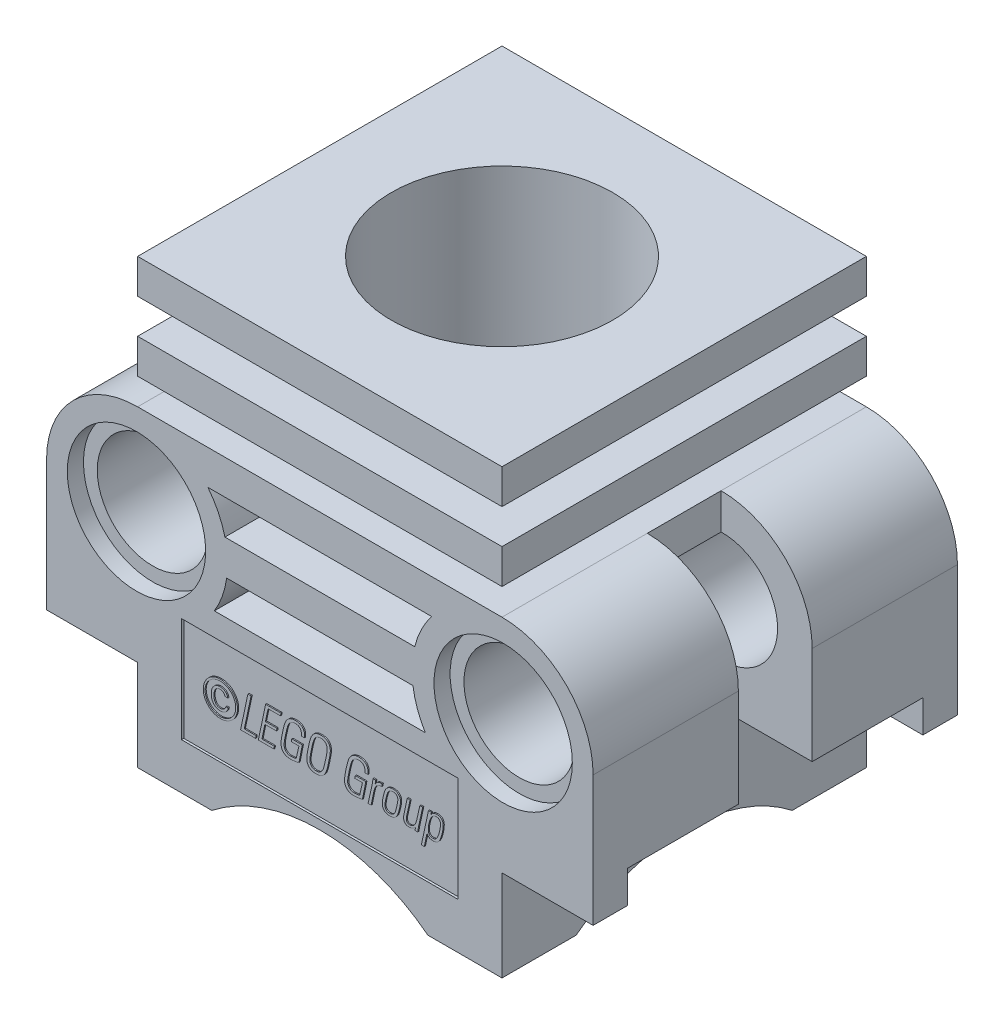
from build123d import *

# Parameters (mm, degrees)
BASE_EXTRUDE_DEPTH  = 7.9
SKETCH2_W           = 12.8
SKETCH2_H           = 12.8
SKETCH2_W_2         = 6.477428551
CUT_EXTRUDE1_DEPTH  = 5.35
SKETCH3_W           = 5.042240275
SKETCH3_H           = 3.2
CUT_EXTRUDE2_DEPTH  = 17.433882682
CUT_EXTRUDE3_DEPTH  = 24.951304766
SKETCH5_R           = 6.3
BOSS_EXTRUDE1_DEPTH = 19.2
SKETCH6_W           = 15.8
SKETCH6_H           = 15.8
BOSS_EXTRUDE2_DEPTH = 1.5
LPATTERN2_COUNT     = 2
LPATTERN2_PITCH     = 3
SKETCH8_R           = 4.8
CUT_EXTRUDE4_DEPTH  = 24.905491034
SKETCH9_R           = 3
CUT_EXTRUDE5_DEPTH  = 0.7
SKETCH10_R          = 2.4
CUT_EXTRUDE6_DEPTH  = 28.14907923
SKETCH12_R          = 7.62
CUT_EXTRUDE8_DEPTH  = 24.905491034
CIRPATTERN1_COUNT   = 2
CIRPATTERN1_ANGLE   = 90
CUT_EXTRUDE9_DEPTH  = 2.5
SKETCH14_W          = 12
SKETCH14_H          = 4.55
CUT_EXTRUDE10_DEPTH = 0.1
BOSS_EXTRUDE4_DEPTH = 0.05
CIRPATTERN2_COUNT   = 2
BOSS_EXTRUDE5_START = -2.85
BOSS_EXTRUDE5_DEPTH = 2.85


with BuildPart() as part:
    # Sketch1 → Base-Extrude (new, symmetric)
    with BuildSketch(Plane.XY):
        with BuildLine():
            Line((-7.9, 0), (7.9, 0))
            Line((7.9, 0), (7.9, 3.95))
            Line((7.9, 3.95), (11.85, 3.95))
            Line((11.85, 3.95), (11.85, 9.6))
            ThreePointArc((11.85, 9.6), (10.693071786, 12.393071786), (7.9, 13.55))
            Line((7.9, 13.55), (-7.9, 13.55))
            ThreePointArc((-7.9, 13.55), (-10.693071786, 12.393071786), (-11.85, 9.6))
            Line((-11.85, 9.6), (-11.85, 3.95))
            Line((-11.85, 3.95), (-7.9, 3.95))
            Line((-7.9, 3.95), (-7.9, 0))
        make_face()
    extrude(amount=BASE_EXTRUDE_DEPTH, both=True)

    # Sketch2 → Cut-Extrude1 (cut)
    with BuildSketch(Plane.XZ):
        Rectangle(SKETCH2_W, SKETCH2_H)
        with Locations((11.138714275, 0)):
            Rectangle(SKETCH2_W_2, SKETCH2_H)
    cut_extrude1 = extrude(amount=-CUT_EXTRUDE1_DEPTH, mode=Mode.SUBTRACT)

    # Sketch3 → Cut-Extrude2 (cut, through all)
    with BuildSketch(Plane.XZ.offset(-5.35)):
        with Locations((10.421120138, 0)):
            Rectangle(SKETCH3_W, SKETCH3_H)
    cut_extrude2 = extrude(amount=-CUT_EXTRUDE2_DEPTH, mode=Mode.SUBTRACT)

    # Mirror1: Cut-Extrude1, Cut-Extrude2 across plane
    add(cut_extrude1.mirror(Plane(origin=(0, 0, 0), x_dir=(0, 0, 1), z_dir=(1, 0, 0))), mode=Mode.SUBTRACT)
    add(cut_extrude2.mirror(Plane(origin=(0, 0, 0), x_dir=(0, 0, 1), z_dir=(1, 0, 0))), mode=Mode.SUBTRACT)

    # Sketch4 → Cut-Extrude3 (cut, through all)
    with BuildSketch(Plane.XY.offset(7.9)):
        with BuildLine():
            Line((-4.851613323, 12.05), (4.851613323, 12.05))
            ThreePointArc((4.851613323, 12.05), (4.403565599, 11.339339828), (4.115942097, 10.55))
            Line((4.115942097, 10.55), (-4.115942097, 10.55))
            ThreePointArc((-4.115942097, 10.55), (-4.403565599, 11.339339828), (-4.851613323, 12.05))
        make_face()
        with BuildLine():
            Line((-4.038478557, 9.05), (4.038478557, 9.05))
            ThreePointArc((4.038478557, 9.05), (4.22966289, 8.272750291), (4.573611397, 7.55))
            Line((4.573611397, 7.55), (-4.573611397, 7.55))
            ThreePointArc((-4.573611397, 7.55), (-4.22966289, 8.272750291), (-4.038478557, 9.05))
        make_face()
    extrude(amount=-CUT_EXTRUDE3_DEPTH, mode=Mode.SUBTRACT)

    # Sketch5 → Boss-Extrude1 (add)
    with BuildSketch(Plane.XZ):
        with Locations(Location((0, 0, 0), (0, 0, 270))):
            Circle(SKETCH5_R)
    extrude(amount=-BOSS_EXTRUDE1_DEPTH)

    # Sketch6 → Boss-Extrude2 (add)
    with BuildSketch(Plane(origin=(0, 19.2, 0), x_dir=(-1, 0, 0), z_dir=(0, 1, 0))):
        Rectangle(SKETCH6_W, SKETCH6_H)
    boss_extrude2 = extrude(amount=-BOSS_EXTRUDE2_DEPTH)

    # LPattern2: Boss-Extrude2 ×2
    with Locations(*[(0, -i * LPATTERN2_PITCH, 0) for i in range(1, LPATTERN2_COUNT)]):
        add(boss_extrude2)

    # Sketch8 → Cut-Extrude4 (cut, through all)
    with BuildSketch(Plane.XZ):
        with Locations(Location((0, 0, 0), (0, 0, 270))):
            Circle(SKETCH8_R)
    extrude(amount=-CUT_EXTRUDE4_DEPTH, mode=Mode.SUBTRACT)

    # Sketch9 → Cut-Extrude5 (cut)
    with BuildSketch(Plane.XY.offset(7.9)):
        with Locations((7.95, 9.6)):
            Circle(SKETCH9_R)
        with Locations(Location((-7.95, 9.6, 0), (0, 0, 180))):
            Circle(SKETCH9_R)
    cut_extrude5 = extrude(amount=-CUT_EXTRUDE5_DEPTH, mode=Mode.SUBTRACT)

    # Mirror2: Cut-Extrude5 across plane
    add(cut_extrude5.mirror(Plane.XY), mode=Mode.SUBTRACT)

    # Sketch10 → Cut-Extrude6 (cut, through all)
    with BuildSketch(Plane.XY.offset(7.2)):
        with Locations((7.95, 9.6)):
            Circle(SKETCH10_R)
        with Locations((-7.95, 9.6)):
            Circle(SKETCH10_R)
    extrude(amount=-CUT_EXTRUDE6_DEPTH, mode=Mode.SUBTRACT)

    # Sketch12 → Cut-Extrude8 (cut, symmetric)
    with BuildSketch(Plane.XY):
        with Locations((0, -6.00788318)):
            Circle(SKETCH12_R)
    cut_extrude8 = extrude(amount=CUT_EXTRUDE8_DEPTH, both=True, mode=Mode.SUBTRACT)

    # CirPattern1: Cut-Extrude8 ×2 about axis
    cirpattern1_axis = Axis((0, 19.2, 0), (0, -1, 0))
    for i in range(1, CIRPATTERN1_COUNT):
        add(cut_extrude8.rotate(cirpattern1_axis, i * CIRPATTERN1_ANGLE / (CIRPATTERN1_COUNT - 1)), mode=Mode.SUBTRACT)

    # Sketch13 → Cut-Extrude9 (cut)
    with BuildSketch(Plane.XZ):
        Polygon((6.4, -6.4), (6.4, -4.687188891), (6.4, 6.4), (-6.4, 6.4), (-6.4, -6.4), align=None)
    extrude(amount=-CUT_EXTRUDE9_DEPTH, mode=Mode.SUBTRACT)

    # Sketch14 → Cut-Extrude10 (cut)
    with BuildSketch(Plane.XY.offset(7.9)):
        with Locations((0, 4.275)):
            Rectangle(SKETCH14_W, SKETCH14_H)
    cut_extrude10 = extrude(amount=-CUT_EXTRUDE10_DEPTH, mode=Mode.SUBTRACT)

    # Sketch15 → Boss-Extrude4 (add)
    # profile 1 of 11: a face of its own
    with BuildSketch(Plane.XY.offset(7.8)):
        with BuildLine():
            add(Edge.make_bspline(
                [(-4.362629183, 5.06703711), (-4.3377211, 5.066290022), (-4.28829752, 5.064807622), (-4.215103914, 5.054549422), (-4.144159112, 5.036503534), (-4.07537083, 5.012185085), (-4.009425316, 4.981158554), (-3.946807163, 4.943730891), (-3.88805169, 4.899648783), (-3.85242363, 4.865868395), (-3.834480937, 4.848856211)],
                knots=[0, 0, 0, 0, 1.018957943, 2.021855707, 3.0162028, 4.009185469, 5.002380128, 5.992645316, 6.989073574, 8, 8, 8, 8], degree=3))
            add(Edge.make_bspline(
                [(-3.834480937, 4.848856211), (-3.817733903, 4.831341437), (-3.784375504, 4.796453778), (-3.74156816, 4.738252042), (-3.704361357, 4.676524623), (-3.674290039, 4.610868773), (-3.649958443, 4.542549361), (-3.633044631, 4.471816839), (-3.621906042, 4.399305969), (-3.620779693, 4.35024136), (-3.620212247, 4.325522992)],
                knots=[0, 0, 0, 0, 1.000946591, 1.993784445, 2.979555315, 3.975955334, 4.974114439, 5.972928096, 6.978776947, 8, 8, 8, 8], degree=3))
            add(Edge.make_bspline(
                [(-3.620212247, 4.325522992), (-3.620806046, 4.300509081), (-3.621977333, 4.251168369), (-3.632557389, 4.178475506), (-3.649695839, 4.108431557), (-3.673529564, 4.041056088), (-3.703948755, 3.976787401), (-3.74103947, 3.916034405), (-3.783956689, 3.858258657), (-3.817525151, 3.823605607), (-3.834480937, 3.806101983)],
                knots=[0, 0, 0, 0, 1.039328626, 2.050107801, 3.04630548, 4.032829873, 5.015822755, 5.996291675, 6.987905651, 8, 8, 8, 8], degree=3))
            add(Edge.make_bspline(
                [(-3.834480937, 3.806101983), (-3.852804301, 3.788856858), (-3.88915595, 3.754644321), (-3.949354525, 3.710468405), (-4.012628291, 3.672038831), (-4.079133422, 3.640129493), (-4.147993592, 3.615107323), (-4.218489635, 3.597427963), (-4.29013484, 3.586047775), (-4.338411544, 3.584689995), (-4.362629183, 3.584008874)],
                knots=[0, 0, 0, 0, 1.026834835, 2.037133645, 3.042569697, 4.046736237, 5.044640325, 6.02933777, 7.011432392, 8, 8, 8, 8], degree=3))
            add(Edge.make_bspline(
                [(-4.362629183, 3.584008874), (-4.386943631, 3.584714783), (-4.435298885, 3.586118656), (-4.506868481, 3.597043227), (-4.576884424, 3.614446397), (-4.644762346, 3.639251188), (-4.710268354, 3.670392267), (-4.772036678, 3.708794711), (-4.831129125, 3.752627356), (-4.866746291, 3.786742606), (-4.884758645, 3.803995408)],
                knots=[0, 0, 0, 0, 1.00281557, 1.994345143, 2.98007901, 3.975109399, 4.971043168, 5.966942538, 6.971839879, 8, 8, 8, 8], degree=3))
            add(Edge.make_bspline(
                [(-4.884758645, 3.803995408), (-4.901907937, 3.821806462), (-4.935964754, 3.857177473), (-4.979655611, 3.915899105), (-5.017419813, 3.977823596), (-5.04863989, 4.042932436), (-5.073097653, 4.110906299), (-5.090583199, 4.180857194), (-5.101048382, 4.252680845), (-5.102505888, 4.301112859), (-5.103240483, 4.325522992)],
                knots=[0, 0, 0, 0, 1.021116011, 2.02783661, 3.017680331, 4.015421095, 5.006948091, 5.998492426, 6.991223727, 8, 8, 8, 8], degree=3))
            add(Edge.make_bspline(
                [(-5.103240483, 4.325522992), (-5.102522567, 4.349835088), (-5.101091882, 4.39828493), (-5.090293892, 4.470107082), (-5.072419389, 4.540463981), (-5.047390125, 4.608962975), (-5.015787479, 4.675138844), (-4.977950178, 4.73832166), (-4.934109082, 4.798380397), (-4.9000956, 4.834742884), (-4.88295301, 4.853069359)],
                knots=[0, 0, 0, 0, 0.994980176, 1.982825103, 2.965844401, 3.962221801, 4.963259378, 5.963294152, 6.973512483, 8, 8, 8, 8], degree=3))
            add(Edge.make_bspline(
                [(-4.88295301, 4.853069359), (-4.865517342, 4.869785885), (-4.830908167, 4.90296759), (-4.773552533, 4.94608885), (-4.71248741, 4.983078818), (-4.647622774, 5.013339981), (-4.579866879, 5.037596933), (-4.509460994, 5.05463818), (-4.43678528, 5.065267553), (-4.387543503, 5.06644259), (-4.362629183, 5.06703711)],
                knots=[0, 0, 0, 0, 1.00234497, 1.989618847, 2.972647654, 3.96216877, 4.956928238, 5.956152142, 6.965896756, 8, 8, 8, 8], degree=3))
        make_face()
        with BuildLine():
            add(Edge.make_bspline(
                [(-3.697252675, 4.324921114), (-3.697802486, 4.347022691), (-3.698894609, 4.390924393), (-3.708532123, 4.455862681), (-3.724227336, 4.519029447), (-3.745950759, 4.580188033), (-3.773305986, 4.638867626), (-3.806168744, 4.69454387), (-3.844914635, 4.746636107), (-3.874404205, 4.778395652), (-3.889251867, 4.794386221)],
                knots=[0, 0, 0, 0, 1.018933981, 2.023970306, 3.020439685, 4.01699499, 5.012615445, 6.002099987, 6.994080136, 8, 8, 8, 8], degree=3))
            add(Edge.make_bspline(
                [(-3.889251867, 4.794386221), (-3.90538198, 4.809808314), (-3.937333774, 4.840357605), (-3.990689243, 4.879378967), (-4.04661717, 4.913392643), (-4.105878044, 4.940938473), (-4.167256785, 4.963101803), (-4.230796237, 4.978694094), (-4.296122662, 4.988375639), (-4.340326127, 4.989453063), (-4.362629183, 4.989996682)],
                knots=[0, 0, 0, 0, 1.017557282, 2.015657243, 3.00970618, 4.001009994, 4.993000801, 5.983500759, 6.982566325, 8, 8, 8, 8], degree=3))
            add(Edge.make_bspline(
                [(-4.362629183, 4.989996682), (-4.38473035, 4.989444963), (-4.428631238, 4.98834905), (-4.493479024, 4.978753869), (-4.556439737, 4.963013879), (-4.617215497, 4.941342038), (-4.675353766, 4.914042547), (-4.730080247, 4.880916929), (-4.781705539, 4.842830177), (-4.812635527, 4.813194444), (-4.828182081, 4.79829843)],
                knots=[0, 0, 0, 0, 1.025734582, 2.03747875, 3.036079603, 4.034897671, 5.028729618, 6.012822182, 7.001171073, 8, 8, 8, 8], degree=3))
            add(Edge.make_bspline(
                [(-4.828182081, 4.79829843), (-4.84353968, 4.781711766), (-4.873953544, 4.748863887), (-4.913872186, 4.695194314), (-4.947996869, 4.638424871), (-4.976275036, 4.578833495), (-4.998498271, 4.517239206), (-5.014687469, 4.454200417), (-5.024131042, 4.3899096), (-5.025509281, 4.346618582), (-5.026200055, 4.324921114)],
                knots=[0, 0, 0, 0, 1.030362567, 2.040508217, 3.044001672, 4.046733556, 5.043824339, 6.025813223, 7.010537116, 8, 8, 8, 8], degree=3))
            add(Edge.make_bspline(
                [(-5.026200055, 4.324921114), (-5.025518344, 4.3032228), (-5.024164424, 4.260128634), (-5.014663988, 4.196141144), (-4.99847856, 4.133644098), (-4.976642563, 4.07259062), (-4.948678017, 4.013863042), (-4.914721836, 3.958346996), (-4.875548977, 3.905796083), (-4.845461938, 3.873932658), (-4.830288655, 3.85786352)],
                knots=[0, 0, 0, 0, 1.001897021, 1.989828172, 2.979668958, 3.97900318, 4.979796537, 5.977647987, 6.980101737, 8, 8, 8, 8], degree=3))
            add(Edge.make_bspline(
                [(-4.830288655, 3.85786352), (-4.814213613, 3.842698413), (-4.782236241, 3.812531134), (-4.729643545, 3.773172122), (-4.673914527, 3.73921844), (-4.615278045, 3.710916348), (-4.554262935, 3.688710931), (-4.491609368, 3.672567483), (-4.427519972, 3.663101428), (-4.384327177, 3.661735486), (-4.362629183, 3.661049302)],
                knots=[0, 0, 0, 0, 1.018033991, 2.025130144, 3.021157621, 4.022120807, 5.021202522, 6.009233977, 6.999934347, 8, 8, 8, 8], degree=3))
            add(Edge.make_bspline(
                [(-4.362629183, 3.661049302), (-4.340925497, 3.661702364), (-4.297607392, 3.663005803), (-4.233298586, 3.673031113), (-4.170028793, 3.688890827), (-4.108340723, 3.711679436), (-4.048646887, 3.740100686), (-3.991769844, 3.774296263), (-3.938131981, 3.81402875), (-3.905616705, 3.844589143), (-3.889251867, 3.859970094)],
                knots=[0, 0, 0, 0, 0.988726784, 1.973386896, 2.95907585, 3.956986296, 4.965064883, 5.967811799, 6.977205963, 8, 8, 8, 8], degree=3))
            add(Edge.make_bspline(
                [(-3.889251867, 3.859970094), (-3.874129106, 3.875596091), (-3.844088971, 3.906635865), (-3.805963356, 3.958610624), (-3.772179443, 4.012913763), (-3.745428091, 4.070897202), (-3.723782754, 4.131274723), (-3.708631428, 4.194026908), (-3.69883785, 4.258807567), (-3.697785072, 4.302716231), (-3.697252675, 4.324921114)],
                knots=[0, 0, 0, 0, 1.008934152, 2.004165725, 2.987050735, 3.975046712, 4.963888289, 5.961734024, 6.969236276, 8, 8, 8, 8], degree=3))
        make_face(mode=Mode.SUBTRACT)
    # profile 2 of 11: a face of its own
    with BuildSketch(Plane.XY.offset(7.8)):
        with BuildLine():
            add(Edge.make_bspline(
                [(-4.159495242, 4.515415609), (-4.163070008, 4.527920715), (-4.170044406, 4.552318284), (-4.187635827, 4.585368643), (-4.20956383, 4.614416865), (-4.236612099, 4.638427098), (-4.267541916, 4.657991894), (-4.302433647, 4.671817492), (-4.340739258, 4.680496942), (-4.367496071, 4.681379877), (-4.381287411, 4.681834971)],
                knots=[0, 0, 0, 0, 1.034583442, 2.018481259, 2.965600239, 3.922832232, 4.88602793, 5.869340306, 6.901787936, 8, 8, 8, 8], degree=3))
            add(Edge.make_bspline(
                [(-4.381287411, 4.681834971), (-4.391237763, 4.681564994), (-4.410743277, 4.681035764), (-4.43907699, 4.676335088), (-4.465801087, 4.669237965), (-4.490852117, 4.65891109), (-4.513995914, 4.645250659), (-4.535519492, 4.62889493), (-4.55537707, 4.60964502), (-4.573235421, 4.587441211), (-4.589250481, 4.562619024), (-4.603103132, 4.535374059), (-4.61482546, 4.505740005), (-4.624426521, 4.473714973), (-4.631877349, 4.43929854), (-4.6373369, 4.402513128), (-4.640183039, 4.363285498), (-4.640721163, 4.336360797), (-4.640997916, 4.322513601)],
                knots=[0, 0, 0, 0, 0.954364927, 1.870826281, 2.749014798, 3.603666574, 4.462321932, 5.321139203, 6.192652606, 7.109872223, 8.049900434, 9.023020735, 10.038511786, 11.104546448, 12.228195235, 13.415499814, 14.67080855, 16, 16, 16, 16], degree=3))
            add(Edge.make_bspline(
                [(-4.640997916, 4.322513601), (-4.640751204, 4.309265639), (-4.640270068, 4.283429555), (-4.63698409, 4.24571445), (-4.631347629, 4.210085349), (-4.623162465, 4.176611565), (-4.613010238, 4.145138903), (-4.600456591, 4.115827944), (-4.585126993, 4.088900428), (-4.568226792, 4.063865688), (-4.548922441, 4.041664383), (-4.528064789, 4.022118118), (-4.505365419, 4.005803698), (-4.480979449, 3.992468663), (-4.45510629, 3.981768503), (-4.427321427, 3.974733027), (-4.398101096, 3.970006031), (-4.377996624, 3.969479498), (-4.367745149, 3.969211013)],
                knots=[0, 0, 0, 0, 1.263666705, 2.46439412, 3.608060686, 4.701172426, 5.748162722, 6.759612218, 7.736430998, 8.699894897, 9.636077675, 10.536616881, 11.420945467, 12.294596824, 13.183057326, 14.083596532, 15.022806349, 16, 16, 16, 16], degree=3))
            add(Edge.make_bspline(
                [(-4.367745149, 3.969211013), (-4.35265286, 3.969867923), (-4.323269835, 3.971146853), (-4.280835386, 3.980490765), (-4.241958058, 3.996828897), (-4.206747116, 4.01897689), (-4.176261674, 4.046774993), (-4.151216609, 4.079074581), (-4.132016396, 4.115758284), (-4.124702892, 4.142475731), (-4.120975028, 4.156094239)],
                knots=[0, 0, 0, 0, 1.079119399, 2.10092667, 3.088298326, 4.081569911, 5.061799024, 6.023337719, 6.992448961, 8, 8, 8, 8], degree=3))
            Line((-4.120975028, 4.156094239), (-4.024674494, 4.156094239))
            add(Edge.make_bspline(
                [(-4.024674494, 4.156094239), (-4.025869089, 4.145926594), (-4.028231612, 4.125818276), (-4.035378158, 4.09665547), (-4.044524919, 4.068680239), (-4.057029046, 4.042406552), (-4.072227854, 4.017549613), (-4.090009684, 3.994006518), (-4.110606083, 3.971948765), (-4.133779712, 3.951622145), (-4.158771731, 3.933072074), (-4.18550689, 3.917008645), (-4.213610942, 3.903417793), (-4.243227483, 3.892259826), (-4.274347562, 3.883552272), (-4.306937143, 3.877182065), (-4.340980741, 3.873601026), (-4.364125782, 3.873142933), (-4.375870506, 3.872910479)],
                knots=[0, 0, 0, 0, 0.986260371, 1.95050462, 2.889531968, 3.819800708, 4.748761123, 5.694736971, 6.65970864, 7.65334055, 8.66317646, 9.65680837, 10.656120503, 11.66933233, 12.704332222, 13.768524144, 14.867659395, 16, 16, 16, 16], degree=3))
            add(Edge.make_bspline(
                [(-4.375870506, 3.872910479), (-4.390139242, 3.873183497), (-4.418009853, 3.873716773), (-4.458523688, 3.880026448), (-4.496732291, 3.889638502), (-4.532931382, 3.902804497), (-4.566657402, 3.920426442), (-4.598293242, 3.941674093), (-4.62761661, 3.966782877), (-4.654364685, 3.995751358), (-4.678238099, 4.027957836), (-4.69969221, 4.062674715), (-4.716954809, 4.10062956), (-4.731371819, 4.141014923), (-4.742947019, 4.184057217), (-4.750872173, 4.22978403), (-4.755835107, 4.278265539), (-4.756312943, 4.311466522), (-4.756558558, 4.328532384)],
                knots=[0, 0, 0, 0, 1.021960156, 1.996158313, 2.930921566, 3.843207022, 4.750120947, 5.651545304, 6.569508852, 7.510803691, 8.471453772, 9.439502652, 10.430355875, 11.453832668, 12.510809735, 13.620872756, 14.777088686, 16, 16, 16, 16], degree=3))
            add(Edge.make_bspline(
                [(-4.756558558, 4.328532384), (-4.756172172, 4.345194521), (-4.755418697, 4.377686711), (-4.750713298, 4.42511799), (-4.742256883, 4.469906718), (-4.730433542, 4.512135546), (-4.715896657, 4.552116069), (-4.697391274, 4.589269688), (-4.675584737, 4.623839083), (-4.650611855, 4.655632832), (-4.623109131, 4.684623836), (-4.592877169, 4.709576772), (-4.56078254, 4.73094604), (-4.526454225, 4.748100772), (-4.490098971, 4.761852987), (-4.451497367, 4.771304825), (-4.410863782, 4.777232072), (-4.383114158, 4.777830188), (-4.368948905, 4.778135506)],
                knots=[0, 0, 0, 0, 1.196898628, 2.334025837, 3.419361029, 4.466545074, 5.481092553, 6.470377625, 7.441922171, 8.411995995, 9.370087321, 10.306500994, 11.221801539, 12.13374922, 13.057210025, 14.007902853, 14.983101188, 16, 16, 16, 16], degree=3))
            add(Edge.make_bspline(
                [(-4.368948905, 4.778135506), (-4.358207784, 4.777882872), (-4.33707554, 4.777385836), (-4.306059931, 4.774109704), (-4.27626098, 4.76835153), (-4.247797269, 4.760221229), (-4.220511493, 4.750071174), (-4.194702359, 4.73719694), (-4.170104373, 4.72223923), (-4.146959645, 4.705087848), (-4.125719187, 4.686248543), (-4.106554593, 4.666002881), (-4.089896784, 4.644221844), (-4.075788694, 4.620972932), (-4.063873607, 4.596556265), (-4.054967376, 4.570622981), (-4.047850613, 4.54358414), (-4.045250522, 4.524881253), (-4.043934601, 4.515415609)],
                knots=[0, 0, 0, 0, 1.121250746, 2.205965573, 3.251297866, 4.285503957, 5.292962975, 6.285785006, 7.291501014, 8.29470614, 9.288687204, 10.251738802, 11.200508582, 12.145166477, 13.086568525, 14.030471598, 15.003209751, 16, 16, 16, 16], degree=3))
            Line((-4.043934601, 4.515415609), (-4.159495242, 4.515415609))
        make_face()
    # profile 3 of 11: a face of its own
    with BuildSketch(Plane.XY.offset(7.8)):
        Polygon((-3.485391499, 3.603268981), (-3.168502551, 5.105557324), (-3.029167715, 5.105557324), (-3.326495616, 3.718829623), (-2.811287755, 3.718829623), (-2.835964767, 3.603268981), align=None)
    # profile 4 of 11: a face of its own
    with BuildSketch(Plane.XY.offset(7.8)):
        Polygon((-2.71498722, 3.603268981), (-2.400806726, 5.105557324), (-1.732721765, 5.105557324), (-1.75649596, 4.989996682), (-2.29397332, 4.989996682), (-2.410737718, 4.450713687), (-1.906062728, 4.450713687), (-1.928633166, 4.335153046), (-2.433007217, 4.335153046), (-2.557596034, 3.718829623), (-2.02162337, 3.718829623), (-2.04329099, 3.603268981), align=None)
    # profile 5 of 11: a face of its own
    with BuildSketch(Plane.XY.offset(7.8)):
        with BuildLine():
            add(Edge.make_bspline(
                [(-0.958104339, 3.630353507), (-0.975950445, 3.626792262), (-1.010699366, 3.619858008), (-1.061570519, 3.610573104), (-1.109787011, 3.602289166), (-1.155350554, 3.595729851), (-1.198187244, 3.590482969), (-1.238243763, 3.587014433), (-1.275456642, 3.584249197), (-1.299364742, 3.584086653), (-1.310805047, 3.584008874)],
                knots=[0, 0, 0, 0, 1.225832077, 2.386870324, 3.483325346, 4.521138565, 5.487527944, 6.389900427, 7.229548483, 8, 8, 8, 8], degree=3))
            add(Edge.make_bspline(
                [(-1.310805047, 3.584008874), (-1.327670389, 3.584253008), (-1.360471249, 3.584727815), (-1.408040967, 3.589674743), (-1.452427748, 3.597379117), (-1.493696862, 3.608124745), (-1.531679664, 3.622295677), (-1.566646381, 3.639377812), (-1.598126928, 3.660087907), (-1.626623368, 3.683578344), (-1.651790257, 3.710273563), (-1.673569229, 3.740008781), (-1.692092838, 3.772681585), (-1.706706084, 3.80858561), (-1.718451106, 3.847152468), (-1.726938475, 3.888746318), (-1.731576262, 3.933293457), (-1.732333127, 3.963984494), (-1.732721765, 3.979743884)],
                knots=[0, 0, 0, 0, 1.222313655, 2.377238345, 3.462882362, 4.486000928, 5.464004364, 6.397432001, 7.301091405, 8.189403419, 9.069130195, 9.953503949, 10.85555242, 11.784749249, 12.757873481, 13.774795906, 14.85739087, 16, 16, 16, 16], degree=3))
            add(Edge.make_bspline(
                [(-1.732721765, 3.979743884), (-1.73242757, 3.99158601), (-1.73178594, 4.017413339), (-1.72826759, 4.059181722), (-1.722460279, 4.107246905), (-1.715666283, 4.151209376), (-1.709546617, 4.190050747), (-1.703612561, 4.222079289), (-1.697854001, 4.256469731), (-1.690657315, 4.292795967), (-1.683643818, 4.33149449), (-1.675395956, 4.372279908), (-1.666711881, 4.415322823), (-1.660611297, 4.444697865), (-1.657486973, 4.459741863)],
                knots=[0, 0, 0, 0, 0.876487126, 1.911592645, 3.100341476, 4.458879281, 5.203351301, 6.010101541, 6.869316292, 7.783654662, 8.750433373, 9.779746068, 10.862929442, 12, 12, 12, 12], degree=3))
            add(Edge.make_bspline(
                [(-1.657486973, 4.459741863), (-1.65420035, 4.474693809), (-1.647820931, 4.503715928), (-1.638108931, 4.546030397), (-1.628798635, 4.585959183), (-1.619925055, 4.623541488), (-1.610782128, 4.658499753), (-1.602030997, 4.691095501), (-1.593711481, 4.721321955), (-1.583099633, 4.757538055), (-1.56998988, 4.798338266), (-1.553785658, 4.842332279), (-1.537882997, 4.880210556), (-1.525832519, 4.90260019), (-1.52025871, 4.912956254)],
                knots=[0, 0, 0, 0, 1.160392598, 2.252352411, 3.290740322, 4.268182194, 5.179221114, 6.029501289, 6.826431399, 7.555467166, 8.890004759, 10.073631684, 11.108980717, 12, 12, 12, 12], degree=3))
            add(Edge.make_bspline(
                [(-1.52025871, 4.912956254), (-1.508704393, 4.931556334), (-1.486175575, 4.96782311), (-1.445003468, 5.015328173), (-1.399903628, 5.055601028), (-1.350135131, 5.088306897), (-1.295438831, 5.113496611), (-1.23591775, 5.131480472), (-1.171247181, 5.142109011), (-1.126570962, 5.143406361), (-1.103457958, 5.144077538)],
                knots=[0, 0, 0, 0, 1.045860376, 2.039237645, 2.994234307, 3.929665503, 4.876250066, 5.864225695, 6.895068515, 8, 8, 8, 8], degree=3))
            add(Edge.make_bspline(
                [(-1.103457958, 5.144077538), (-1.088399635, 5.143801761), (-1.059014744, 5.143263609), (-1.01624167, 5.138705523), (-0.975979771, 5.131206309), (-0.938320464, 5.120857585), (-0.90346806, 5.107067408), (-0.87093701, 5.091004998), (-0.841317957, 5.071150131), (-0.814163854, 5.048671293), (-0.790115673, 5.023345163), (-0.769043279, 4.995636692), (-0.751266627, 4.965441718), (-0.736745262, 4.932722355), (-0.725751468, 4.89764029), (-0.717521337, 4.860308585), (-0.712687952, 4.820495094), (-0.712191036, 4.793095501), (-0.711936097, 4.779038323)],
                knots=[0, 0, 0, 0, 1.187988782, 2.318247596, 3.389450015, 4.41694543, 5.394441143, 6.343149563, 7.273990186, 8.201324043, 9.119525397, 10.023491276, 10.942545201, 11.878052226, 12.841830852, 13.83862194, 14.891119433, 16, 16, 16, 16], degree=3))
            add(Edge.make_bspline(
                [(-0.711936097, 4.779038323), (-0.712106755, 4.773720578), (-0.712500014, 4.761466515), (-0.713973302, 4.740761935), (-0.717240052, 4.715524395), (-0.719656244, 4.697181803), (-0.720964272, 4.687251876)],
                knots=[0, 0, 0, 0, 0.691807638, 1.594182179, 2.69758897, 4, 4, 4, 4], degree=3))
            Line((-0.720964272, 4.687251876), (-0.720964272, 4.681834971))
            Line((-0.720964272, 4.681834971), (-0.853076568, 4.681834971))
            add(Edge.make_bspline(
                [(-0.853076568, 4.681834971), (-0.851989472, 4.6888468), (-0.84992944, 4.702134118), (-0.848246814, 4.721641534), (-0.846854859, 4.73999613), (-0.84678913, 4.752051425), (-0.846756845, 4.757972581)],
                knots=[0, 0, 0, 0, 1.112961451, 2.109046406, 3.071227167, 4, 4, 4, 4], degree=3))
            add(Edge.make_bspline(
                [(-0.846756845, 4.757972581), (-0.847035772, 4.768410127), (-0.847578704, 4.788726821), (-0.850397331, 4.818263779), (-0.855943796, 4.845927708), (-0.863407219, 4.871832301), (-0.872956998, 4.896153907), (-0.885175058, 4.918378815), (-0.898982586, 4.939184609), (-0.915306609, 4.957741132), (-0.933440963, 4.974431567), (-0.953456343, 4.988926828), (-0.975188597, 5.001393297), (-0.998904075, 5.011240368), (-1.024260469, 5.01917848), (-1.051426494, 5.02439248), (-1.080298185, 5.027834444), (-1.100136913, 5.028284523), (-1.110379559, 5.028516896)],
                knots=[0, 0, 0, 0, 1.166547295, 2.270685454, 3.310422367, 4.31425725, 5.280012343, 6.222860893, 7.143051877, 8.064607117, 8.976914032, 9.89162764, 10.820312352, 11.769601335, 12.755186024, 13.783929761, 14.855852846, 16, 16, 16, 16], degree=3))
            add(Edge.make_bspline(
                [(-1.110379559, 5.028516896), (-1.12727862, 5.028000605), (-1.160148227, 5.026996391), (-1.207397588, 5.017457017), (-1.250769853, 5.002088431), (-1.290262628, 4.980414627), (-1.326126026, 4.952036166), (-1.358624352, 4.916919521), (-1.388771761, 4.875339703), (-1.405380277, 4.84407029), (-1.414027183, 4.827790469)],
                knots=[0, 0, 0, 0, 1.048026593, 2.038469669, 2.978039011, 3.894986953, 4.821840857, 5.804264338, 6.85683226, 8, 8, 8, 8], degree=3))
            add(Edge.make_bspline(
                [(-1.414027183, 4.827790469), (-1.418268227, 4.818917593), (-1.42760535, 4.799382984), (-1.439788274, 4.766232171), (-1.452823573, 4.727321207), (-1.463302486, 4.690927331), (-1.472512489, 4.658468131), (-1.47911996, 4.630847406), (-1.486824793, 4.601025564), (-1.494663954, 4.568725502), (-1.502584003, 4.533945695), (-1.511573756, 4.496936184), (-1.520073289, 4.457415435), (-1.526155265, 4.43034516), (-1.529286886, 4.416406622)],
                knots=[0, 0, 0, 0, 0.826735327, 1.820148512, 2.967388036, 4.278160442, 5.00481677, 5.804905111, 6.666383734, 7.595406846, 8.600254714, 9.666453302, 10.798452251, 12, 12, 12, 12], degree=3))
            add(Edge.make_bspline(
                [(-1.529286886, 4.416406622), (-1.532575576, 4.400452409), (-1.538926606, 4.369642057), (-1.548414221, 4.325377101), (-1.556350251, 4.28447097), (-1.564166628, 4.247250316), (-1.570177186, 4.213247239), (-1.576194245, 4.182942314), (-1.580473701, 4.156081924), (-1.585797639, 4.12598385), (-1.590225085, 4.092740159), (-1.594658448, 4.056954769), (-1.597183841, 4.025823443), (-1.597675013, 4.006631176), (-1.597901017, 3.997800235)],
                knots=[0, 0, 0, 0, 1.380724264, 2.666417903, 3.83700122, 4.912538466, 5.889783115, 6.763609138, 7.531013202, 8.194978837, 9.354142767, 10.372930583, 11.251336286, 12, 12, 12, 12], degree=3))
            add(Edge.make_bspline(
                [(-1.597901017, 3.997800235), (-1.59768544, 3.986454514), (-1.597266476, 3.964404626), (-1.593572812, 3.932293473), (-1.587616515, 3.902071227), (-1.579196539, 3.873636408), (-1.568330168, 3.847010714), (-1.555126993, 3.822222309), (-1.539299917, 3.799457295), (-1.521212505, 3.778704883), (-1.501155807, 3.759965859), (-1.478846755, 3.74400506), (-1.45517724, 3.730052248), (-1.429494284, 3.718853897), (-1.402176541, 3.710104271), (-1.372884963, 3.704278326), (-1.342020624, 3.700121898), (-1.320750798, 3.699756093), (-1.30990223, 3.699569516)],
                knots=[0, 0, 0, 0, 1.159097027, 2.25265184, 3.298060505, 4.303502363, 5.27816348, 6.232119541, 7.167667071, 8.105010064, 9.040782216, 9.96554058, 10.902659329, 11.843582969, 12.822654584, 13.827887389, 14.892124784, 16, 16, 16, 16], degree=3))
            add(Edge.make_bspline(
                [(-1.30990223, 3.699569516), (-1.289024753, 3.699904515), (-1.248199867, 3.700559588), (-1.188154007, 3.706044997), (-1.1303295, 3.71542373), (-1.093057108, 3.725344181), (-1.074567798, 3.730265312)],
                knots=[0, 0, 0, 0, 1.052006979, 2.057148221, 3.036230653, 4, 4, 4, 4], degree=3))
            Line((-1.074567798, 3.730265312), (-0.955997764, 4.258112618))
            Line((-0.955997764, 4.258112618), (-1.289739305, 4.258112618))
            Line((-1.289739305, 4.258112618), (-1.264761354, 4.37367326))
            Line((-1.264761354, 4.37367326), (-0.808236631, 4.37367326))
            Line((-0.808236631, 4.37367326), (-0.911157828, 3.85786352))
            add(Edge.make_bspline(
                [(-0.911157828, 3.85786352), (-0.914716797, 3.842124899), (-0.922094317, 3.809499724), (-0.930753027, 3.767528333), (-0.937835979, 3.731066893), (-0.943820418, 3.70024375), (-0.95080634, 3.666370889), (-0.955603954, 3.642693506), (-0.958104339, 3.630353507)],
                knots=[0, 0, 0, 0, 1.25022728, 2.591642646, 3.320264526, 4.128149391, 5.0244431, 6, 6, 6, 6], degree=3))
        make_face()
    # profile 6 of 11: a face of its own
    with BuildSketch(Plane.XY.offset(7.8)):
        with BuildLine():
            add(Edge.make_bspline(
                [(-0.615635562, 3.971919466), (-0.615371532, 3.984265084), (-0.614786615, 4.011614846), (-0.610514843, 4.056287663), (-0.603727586, 4.108532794), (-0.594628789, 4.168322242), (-0.583257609, 4.235773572), (-0.568772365, 4.310492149), (-0.553156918, 4.392776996), (-0.541017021, 4.44983391), (-0.534682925, 4.479603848)],
                knots=[0, 0, 0, 0, 0.575618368, 1.2751913, 2.090889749, 3.032200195, 4.094896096, 5.28012256, 6.580880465, 8, 8, 8, 8], degree=3))
            add(Edge.make_bspline(
                [(-0.534682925, 4.479603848), (-0.529431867, 4.504519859), (-0.519238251, 4.552888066), (-0.50167411, 4.622649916), (-0.484974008, 4.688073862), (-0.466884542, 4.747965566), (-0.449397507, 4.80167826), (-0.432810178, 4.847850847), (-0.417069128, 4.885959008), (-0.40561425, 4.907904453), (-0.400464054, 4.917771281)],
                knots=[0, 0, 0, 0, 1.329892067, 2.581652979, 3.757237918, 4.856338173, 5.848855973, 6.707462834, 7.418866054, 8, 8, 8, 8], degree=3))
            add(Edge.make_bspline(
                [(-0.400464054, 4.917771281), (-0.394545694, 4.927365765), (-0.382883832, 4.946271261), (-0.3639517, 4.973052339), (-0.344048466, 4.997680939), (-0.323591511, 5.020538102), (-0.301901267, 5.040893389), (-0.279511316, 5.059284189), (-0.256609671, 5.076115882), (-0.22415917, 5.095419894), (-0.179910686, 5.115428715), (-0.121617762, 5.13200169), (-0.057667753, 5.142459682), (-0.013098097, 5.143525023), (0.010016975, 5.144077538)],
                knots=[0, 0, 0, 0, 0.82075713, 1.617264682, 2.386162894, 3.125665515, 3.849083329, 4.549605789, 5.234880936, 5.916369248, 7.29592212, 8.756850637, 10.318011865, 12, 12, 12, 12], degree=3))
            add(Edge.make_bspline(
                [(0.010016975, 5.144077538), (0.025580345, 5.143839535), (0.055783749, 5.143377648), (0.099637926, 5.138355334), (0.140774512, 5.130739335), (0.179068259, 5.11960211), (0.214548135, 5.105386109), (0.247309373, 5.08830901), (0.27707465, 5.06761631), (0.303843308, 5.043781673), (0.327863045, 5.017103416), (0.348702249, 4.987512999), (0.366116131, 4.954994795), (0.380851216, 4.919930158), (0.391293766, 4.881707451), (0.399575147, 4.841027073), (0.404410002, 4.797411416), (0.404898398, 4.76741387), (0.405150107, 4.751953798)],
                knots=[0, 0, 0, 0, 1.175277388, 2.280828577, 3.330169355, 4.332652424, 5.288203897, 6.213680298, 7.11765186, 8.019524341, 8.915743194, 9.824056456, 10.746424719, 11.697819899, 12.690920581, 13.734278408, 14.832297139, 16, 16, 16, 16], degree=3))
            add(Edge.make_bspline(
                [(0.405150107, 4.751953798), (0.404864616, 4.74051188), (0.404245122, 4.715683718), (0.400569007, 4.675347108), (0.395279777, 4.6289566), (0.388708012, 4.586286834), (0.38246124, 4.548605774), (0.377070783, 4.516782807), (0.370651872, 4.48231056), (0.363848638, 4.444952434), (0.355921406, 4.405066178), (0.347541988, 4.362403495), (0.338143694, 4.317096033), (0.33171717, 4.285900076), (0.328410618, 4.269849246)],
                knots=[0, 0, 0, 0, 0.842807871, 1.828834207, 2.981748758, 4.28162173, 5.007991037, 5.795100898, 6.658829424, 7.590630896, 8.591902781, 9.654024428, 10.792957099, 12, 12, 12, 12], degree=3))
            add(Edge.make_bspline(
                [(0.328410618, 4.269849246), (0.324900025, 4.25379907), (0.318097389, 4.222697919), (0.308189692, 4.177429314), (0.298656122, 4.135173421), (0.289236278, 4.09587043), (0.280328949, 4.059624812), (0.271540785, 4.026332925), (0.263100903, 3.99606806), (0.253008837, 3.960426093), (0.240665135, 3.920672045), (0.224918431, 3.878026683), (0.209394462, 3.841104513), (0.197370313, 3.819259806), (0.191784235, 3.809111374)],
                knots=[0, 0, 0, 0, 1.226824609, 2.37727363, 3.460296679, 4.461369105, 5.395165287, 6.247276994, 7.032354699, 7.741269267, 9.013447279, 10.139147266, 11.135500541, 12, 12, 12, 12], degree=3))
            add(Edge.make_bspline(
                [(0.191784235, 3.809111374), (0.186305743, 3.799693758), (0.175535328, 3.781179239), (0.157163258, 3.755231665), (0.138216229, 3.730903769), (0.117702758, 3.708760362), (0.096524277, 3.688309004), (0.074068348, 3.669821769), (0.050535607, 3.653213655), (0.025780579, 3.638440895), (-0.0002429, 3.625392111), (-0.027646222, 3.614332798), (-0.056387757, 3.604919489), (-0.086598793, 3.597489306), (-0.118247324, 3.591514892), (-0.151366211, 3.586848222), (-0.185963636, 3.584619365), (-0.209465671, 3.584214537), (-0.221405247, 3.584008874)],
                knots=[0, 0, 0, 0, 1.052351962, 2.068866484, 3.069589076, 4.030112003, 4.98312133, 5.91277099, 6.837962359, 7.763965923, 8.696038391, 9.648307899, 10.617013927, 11.616232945, 12.652386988, 13.728578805, 14.84606553, 16, 16, 16, 16], degree=3))
            add(Edge.make_bspline(
                [(-0.221405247, 3.584008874), (-0.236665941, 3.584259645), (-0.266365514, 3.584747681), (-0.309563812, 3.589626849), (-0.350034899, 3.597716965), (-0.387907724, 3.60889723), (-0.423312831, 3.622936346), (-0.456055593, 3.640469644), (-0.485953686, 3.661385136), (-0.513235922, 3.685188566), (-0.537328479, 3.712173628), (-0.558540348, 3.741620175), (-0.575971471, 3.773909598), (-0.590517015, 3.80846635), (-0.601990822, 3.845645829), (-0.60997231, 3.885469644), (-0.61490809, 3.92785739), (-0.615388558, 3.956958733), (-0.615635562, 3.971919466)],
                knots=[0, 0, 0, 0, 1.16414172, 2.265592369, 3.311935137, 4.309808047, 5.274966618, 6.213345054, 7.137059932, 8.05373864, 8.969777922, 9.891651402, 10.816570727, 11.763403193, 12.74883821, 13.780177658, 14.858809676, 16, 16, 16, 16], degree=3))
        make_face()
        with BuildLine():
            add(Edge.make_bspline(
                [(0.001289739, 5.028516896), (-0.015906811, 5.028096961), (-0.049038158, 5.027287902), (-0.096212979, 5.018350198), (-0.138757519, 5.004364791), (-0.176871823, 4.984066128), (-0.211047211, 4.95660926), (-0.242497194, 4.922000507), (-0.271751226, 4.8798151), (-0.288272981, 4.848061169), (-0.296940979, 4.831401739)],
                knots=[0, 0, 0, 0, 1.080335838, 2.08140476, 3.007134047, 3.887802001, 4.781481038, 5.750383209, 6.819757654, 8, 8, 8, 8], degree=3))
            add(Edge.make_bspline(
                [(-0.296940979, 4.831401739), (-0.300551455, 4.823518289), (-0.308842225, 4.805415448), (-0.320151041, 4.773835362), (-0.33286957, 4.734822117), (-0.346018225, 4.688772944), (-0.360047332, 4.636802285), (-0.374467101, 4.58003605), (-0.38895158, 4.518844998), (-0.398127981, 4.476510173), (-0.402871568, 4.454625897)],
                knots=[0, 0, 0, 0, 0.530694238, 1.218638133, 2.051874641, 3.043172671, 4.150157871, 5.347821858, 6.629001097, 8, 8, 8, 8], degree=3))
            add(Edge.make_bspline(
                [(-0.402871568, 4.454625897), (-0.40630454, 4.43807877), (-0.412938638, 4.406102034), (-0.422222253, 4.359527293), (-0.431060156, 4.316032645), (-0.438703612, 4.275451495), (-0.446160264, 4.237997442), (-0.452262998, 4.203530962), (-0.458194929, 4.172088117), (-0.464257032, 4.135361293), (-0.470841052, 4.094708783), (-0.476209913, 4.051237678), (-0.479845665, 4.014611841), (-0.480515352, 3.992389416), (-0.480814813, 3.982452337)],
                knots=[0, 0, 0, 0, 1.269945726, 2.454125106, 3.568819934, 4.605187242, 5.557279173, 6.438514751, 7.235470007, 7.961690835, 9.235746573, 10.329704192, 11.25310301, 12, 12, 12, 12], degree=3))
            add(Edge.make_bspline(
                [(-0.480814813, 3.982452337), (-0.480569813, 3.97161005), (-0.480089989, 3.950375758), (-0.476761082, 3.919485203), (-0.471414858, 3.890482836), (-0.463876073, 3.863341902), (-0.453999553, 3.838126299), (-0.441868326, 3.814738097), (-0.427652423, 3.793243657), (-0.411387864, 3.773586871), (-0.393019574, 3.756077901), (-0.372612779, 3.740998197), (-0.350668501, 3.727859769), (-0.326566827, 3.717731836), (-0.300963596, 3.709668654), (-0.273626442, 3.703437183), (-0.244349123, 3.700330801), (-0.224219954, 3.699827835), (-0.213881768, 3.699569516)],
                knots=[0, 0, 0, 0, 1.177093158, 2.305301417, 3.369110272, 4.375974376, 5.358932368, 6.303989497, 7.231370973, 8.151754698, 9.068522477, 9.979058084, 10.901823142, 11.838559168, 12.809923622, 13.814074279, 14.877325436, 16, 16, 16, 16], degree=3))
            add(Edge.make_bspline(
                [(-0.213881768, 3.699569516), (-0.196986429, 3.700114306), (-0.164457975, 3.701163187), (-0.117764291, 3.710116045), (-0.075252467, 3.72439041), (-0.036591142, 3.744994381), (-0.001655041, 3.772544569), (0.030242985, 3.806992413), (0.059679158, 3.848271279), (0.075898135, 3.879308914), (0.084348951, 3.895480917)],
                knots=[0, 0, 0, 0, 1.066706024, 2.053720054, 2.991776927, 3.890687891, 4.807366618, 5.789382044, 6.848168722, 8, 8, 8, 8], degree=3))
            add(Edge.make_bspline(
                [(0.084348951, 3.895480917), (0.088351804, 3.904572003), (0.097138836, 3.924528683), (0.109304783, 3.957881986), (0.121475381, 3.997246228), (0.134547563, 4.04289195), (0.148438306, 4.095858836), (0.16302798, 4.157019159), (0.178997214, 4.226534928), (0.189728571, 4.275756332), (0.195395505, 4.301748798)],
                knots=[0, 0, 0, 0, 0.565071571, 1.240440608, 2.018442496, 2.909050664, 3.941793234, 5.133691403, 6.486381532, 8, 8, 8, 8], degree=3))
            add(Edge.make_bspline(
                [(0.195395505, 4.301748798), (0.198922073, 4.318096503), (0.205734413, 4.349675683), (0.215318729, 4.395328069), (0.224099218, 4.437549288), (0.231918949, 4.476371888), (0.238864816, 4.511778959), (0.244769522, 4.54381871), (0.250432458, 4.572328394), (0.255670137, 4.605081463), (0.261650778, 4.641103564), (0.266294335, 4.679871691), (0.269739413, 4.713071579), (0.270144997, 4.73338918), (0.270329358, 4.742624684)],
                knots=[0, 0, 0, 0, 1.344629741, 2.597447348, 3.750577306, 4.811939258, 5.781569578, 6.65158919, 7.431436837, 8.118277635, 9.318319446, 10.366731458, 11.257586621, 12, 12, 12, 12], degree=3))
            add(Edge.make_bspline(
                [(0.270329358, 4.742624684), (0.270043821, 4.753762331), (0.269489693, 4.775376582), (0.266766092, 4.806952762), (0.260778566, 4.836341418), (0.253574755, 4.864000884), (0.243335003, 4.889319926), (0.23180033, 4.913216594), (0.217191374, 4.934697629), (0.200921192, 4.954512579), (0.182522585, 4.971993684), (0.162085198, 4.987186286), (0.139929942, 5.00013612), (0.115707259, 5.010425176), (0.089776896, 5.018450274), (0.06193106, 5.024643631), (0.032156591, 5.027744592), (0.01172805, 5.028255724), (0.001289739, 5.028516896)],
                knots=[0, 0, 0, 0, 1.196268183, 2.321535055, 3.396668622, 4.413069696, 5.38507652, 6.324309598, 7.256289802, 8.1664195, 9.072973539, 9.973364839, 10.895145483, 11.821445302, 12.792258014, 13.806259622, 14.879071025, 16, 16, 16, 16], degree=3))
        make_face(mode=Mode.SUBTRACT)
    # profile 7 of 11: a face of its own
    with BuildSketch(Plane.XY.offset(7.8)):
        with BuildLine():
            add(Edge.make_bspline(
                [(1.796090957, 3.630353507), (1.77824485, 3.626792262), (1.743495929, 3.619858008), (1.692624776, 3.610573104), (1.644408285, 3.602289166), (1.598844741, 3.595729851), (1.556008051, 3.590482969), (1.515951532, 3.587014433), (1.478738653, 3.584249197), (1.454830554, 3.584086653), (1.443390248, 3.584008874)],
                knots=[0, 0, 0, 0, 1.225832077, 2.386870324, 3.483325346, 4.521138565, 5.487527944, 6.389900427, 7.229548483, 8, 8, 8, 8], degree=3))
            add(Edge.make_bspline(
                [(1.443390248, 3.584008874), (1.426524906, 3.584253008), (1.393724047, 3.584727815), (1.346154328, 3.589674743), (1.301767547, 3.597379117), (1.260498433, 3.608124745), (1.222515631, 3.622295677), (1.187548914, 3.639377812), (1.156068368, 3.660087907), (1.127571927, 3.683578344), (1.102405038, 3.710273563), (1.080626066, 3.740008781), (1.062102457, 3.772681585), (1.047489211, 3.80858561), (1.035744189, 3.847152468), (1.02725682, 3.888746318), (1.022619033, 3.933293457), (1.021862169, 3.963984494), (1.02147353, 3.979743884)],
                knots=[0, 0, 0, 0, 1.222313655, 2.377238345, 3.462882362, 4.486000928, 5.464004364, 6.397432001, 7.301091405, 8.189403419, 9.069130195, 9.953503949, 10.85555242, 11.784749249, 12.757873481, 13.774795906, 14.85739087, 16, 16, 16, 16], degree=3))
            add(Edge.make_bspline(
                [(1.02147353, 3.979743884), (1.021767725, 3.99158601), (1.022409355, 4.017413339), (1.025927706, 4.059181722), (1.031735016, 4.107246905), (1.038529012, 4.151209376), (1.044648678, 4.190050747), (1.050582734, 4.222079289), (1.056341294, 4.256469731), (1.06353798, 4.292795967), (1.070551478, 4.33149449), (1.078799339, 4.372279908), (1.087483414, 4.415322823), (1.093583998, 4.444697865), (1.096708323, 4.459741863)],
                knots=[0, 0, 0, 0, 0.876487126, 1.911592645, 3.100341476, 4.458879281, 5.203351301, 6.010101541, 6.869316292, 7.783654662, 8.750433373, 9.779746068, 10.862929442, 12, 12, 12, 12], degree=3))
            add(Edge.make_bspline(
                [(1.096708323, 4.459741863), (1.099994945, 4.474693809), (1.106374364, 4.503715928), (1.116086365, 4.546030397), (1.12539666, 4.585959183), (1.13427024, 4.623541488), (1.143413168, 4.658499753), (1.152164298, 4.691095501), (1.160483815, 4.721321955), (1.171095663, 4.757538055), (1.184205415, 4.798338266), (1.200409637, 4.842332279), (1.216312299, 4.880210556), (1.228362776, 4.90260019), (1.233936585, 4.912956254)],
                knots=[0, 0, 0, 0, 1.160392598, 2.252352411, 3.290740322, 4.268182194, 5.179221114, 6.029501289, 6.826431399, 7.555467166, 8.890004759, 10.073631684, 11.108980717, 12, 12, 12, 12], degree=3))
            add(Edge.make_bspline(
                [(1.233936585, 4.912956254), (1.245490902, 4.931556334), (1.26801972, 4.96782311), (1.309191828, 5.015328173), (1.354291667, 5.055601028), (1.404060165, 5.088306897), (1.458756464, 5.113496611), (1.518277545, 5.131480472), (1.582948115, 5.142109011), (1.627624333, 5.143406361), (1.650737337, 5.144077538)],
                knots=[0, 0, 0, 0, 1.045860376, 2.039237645, 2.994234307, 3.929665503, 4.876250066, 5.864225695, 6.895068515, 8, 8, 8, 8], degree=3))
            add(Edge.make_bspline(
                [(1.650737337, 5.144077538), (1.66579566, 5.143801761), (1.695180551, 5.143263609), (1.737953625, 5.138705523), (1.778215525, 5.131206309), (1.815874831, 5.120857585), (1.850727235, 5.107067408), (1.883258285, 5.091004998), (1.912877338, 5.071150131), (1.940031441, 5.048671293), (1.964079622, 5.023345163), (1.985152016, 4.995636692), (2.002928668, 4.965441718), (2.017450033, 4.932722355), (2.028443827, 4.89764029), (2.036673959, 4.860308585), (2.041507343, 4.820495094), (2.042004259, 4.793095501), (2.042259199, 4.779038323)],
                knots=[0, 0, 0, 0, 1.187988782, 2.318247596, 3.389450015, 4.41694543, 5.394441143, 6.343149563, 7.273990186, 8.201324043, 9.119525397, 10.023491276, 10.942545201, 11.878052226, 12.841830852, 13.83862194, 14.891119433, 16, 16, 16, 16], degree=3))
            add(Edge.make_bspline(
                [(2.042259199, 4.779038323), (2.042088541, 4.773720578), (2.041695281, 4.761466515), (2.040221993, 4.740761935), (2.036955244, 4.715524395), (2.034539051, 4.697181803), (2.033231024, 4.687251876)],
                knots=[0, 0, 0, 0, 0.691807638, 1.594182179, 2.69758897, 4, 4, 4, 4], degree=3))
            Line((2.033231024, 4.687251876), (2.033231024, 4.681834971))
            Line((2.033231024, 4.681834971), (1.901118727, 4.681834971))
            add(Edge.make_bspline(
                [(1.901118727, 4.681834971), (1.902205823, 4.6888468), (1.904265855, 4.702134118), (1.905948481, 4.721641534), (1.907340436, 4.73999613), (1.907406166, 4.752051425), (1.90743845, 4.757972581)],
                knots=[0, 0, 0, 0, 1.112961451, 2.109046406, 3.071227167, 4, 4, 4, 4], degree=3))
            add(Edge.make_bspline(
                [(1.90743845, 4.757972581), (1.907159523, 4.768410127), (1.906616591, 4.788726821), (1.903797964, 4.818263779), (1.898251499, 4.845927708), (1.890788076, 4.871832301), (1.881238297, 4.896153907), (1.869020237, 4.918378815), (1.855212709, 4.939184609), (1.838888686, 4.957741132), (1.820754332, 4.974431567), (1.800738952, 4.988926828), (1.779006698, 5.001393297), (1.755291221, 5.011240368), (1.729934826, 5.01917848), (1.702768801, 5.02439248), (1.673897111, 5.027834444), (1.654058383, 5.028284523), (1.643815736, 5.028516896)],
                knots=[0, 0, 0, 0, 1.166547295, 2.270685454, 3.310422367, 4.31425725, 5.280012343, 6.222860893, 7.143051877, 8.064607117, 8.976914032, 9.89162764, 10.820312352, 11.769601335, 12.755186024, 13.783929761, 14.855852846, 16, 16, 16, 16], degree=3))
            add(Edge.make_bspline(
                [(1.643815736, 5.028516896), (1.626916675, 5.028000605), (1.594047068, 5.026996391), (1.546797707, 5.017457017), (1.503425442, 5.002088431), (1.463932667, 4.980414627), (1.42806927, 4.952036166), (1.395570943, 4.916919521), (1.365423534, 4.875339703), (1.348815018, 4.84407029), (1.340168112, 4.827790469)],
                knots=[0, 0, 0, 0, 1.048026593, 2.038469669, 2.978039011, 3.894986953, 4.821840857, 5.804264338, 6.85683226, 8, 8, 8, 8], degree=3))
            add(Edge.make_bspline(
                [(1.340168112, 4.827790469), (1.335927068, 4.818917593), (1.326589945, 4.799382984), (1.314407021, 4.766232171), (1.301371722, 4.727321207), (1.290892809, 4.690927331), (1.281682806, 4.658468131), (1.275075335, 4.630847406), (1.267370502, 4.601025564), (1.259531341, 4.568725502), (1.251611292, 4.533945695), (1.242621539, 4.496936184), (1.234122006, 4.457415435), (1.228040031, 4.43034516), (1.22490841, 4.416406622)],
                knots=[0, 0, 0, 0, 0.826735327, 1.820148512, 2.967388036, 4.278160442, 5.00481677, 5.804905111, 6.666383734, 7.595406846, 8.600254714, 9.666453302, 10.798452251, 12, 12, 12, 12], degree=3))
            add(Edge.make_bspline(
                [(1.22490841, 4.416406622), (1.22161972, 4.400452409), (1.215268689, 4.369642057), (1.205781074, 4.325377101), (1.197845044, 4.28447097), (1.190028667, 4.247250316), (1.184018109, 4.213247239), (1.17800105, 4.182942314), (1.173721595, 4.156081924), (1.168397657, 4.12598385), (1.16397021, 4.092740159), (1.159536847, 4.056954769), (1.157011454, 4.025823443), (1.156520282, 4.006631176), (1.156294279, 3.997800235)],
                knots=[0, 0, 0, 0, 1.380724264, 2.666417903, 3.83700122, 4.912538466, 5.889783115, 6.763609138, 7.531013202, 8.194978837, 9.354142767, 10.372930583, 11.251336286, 12, 12, 12, 12], degree=3))
            add(Edge.make_bspline(
                [(1.156294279, 3.997800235), (1.156509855, 3.986454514), (1.156928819, 3.964404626), (1.160622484, 3.932293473), (1.16657878, 3.902071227), (1.174998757, 3.873636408), (1.185865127, 3.847010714), (1.199068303, 3.822222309), (1.214895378, 3.799457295), (1.232982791, 3.778704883), (1.253039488, 3.759965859), (1.27534854, 3.74400506), (1.299018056, 3.730052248), (1.324701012, 3.718853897), (1.352018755, 3.710104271), (1.381310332, 3.704278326), (1.412174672, 3.700121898), (1.433444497, 3.699756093), (1.444293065, 3.699569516)],
                knots=[0, 0, 0, 0, 1.159097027, 2.25265184, 3.298060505, 4.303502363, 5.27816348, 6.232119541, 7.167667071, 8.105010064, 9.040782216, 9.96554058, 10.902659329, 11.843582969, 12.822654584, 13.827887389, 14.892124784, 16, 16, 16, 16], degree=3))
            add(Edge.make_bspline(
                [(1.444293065, 3.699569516), (1.465170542, 3.699904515), (1.505995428, 3.700559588), (1.566041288, 3.706044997), (1.623865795, 3.71542373), (1.661138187, 3.725344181), (1.679627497, 3.730265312)],
                knots=[0, 0, 0, 0, 1.052006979, 2.057148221, 3.036230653, 4, 4, 4, 4], degree=3))
            Line((1.679627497, 3.730265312), (1.798197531, 4.258112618))
            Line((1.798197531, 4.258112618), (1.46445599, 4.258112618))
            Line((1.46445599, 4.258112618), (1.489433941, 4.37367326))
            Line((1.489433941, 4.37367326), (1.945958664, 4.37367326))
            Line((1.945958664, 4.37367326), (1.843037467, 3.85786352))
            add(Edge.make_bspline(
                [(1.843037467, 3.85786352), (1.839478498, 3.842124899), (1.832100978, 3.809499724), (1.823442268, 3.767528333), (1.816359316, 3.731066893), (1.810374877, 3.70024375), (1.803388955, 3.666370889), (1.798591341, 3.642693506), (1.796090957, 3.630353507)],
                knots=[0, 0, 0, 0, 1.25022728, 2.591642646, 3.320264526, 4.128149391, 5.0244431, 6, 6, 6, 6], degree=3))
        make_face()
    # profile 8 of 11: a face of its own
    with BuildSketch(Plane.XY.offset(7.8)):
        with BuildLine():
            Line((2.042259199, 3.603268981), (2.221919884, 4.406475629))
            add(Edge.make_bspline(
                [(2.221919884, 4.406475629), (2.225865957, 4.425510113), (2.233859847, 4.464069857), (2.243467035, 4.522948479), (2.252437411, 4.582794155), (2.256768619, 4.623133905), (2.258935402, 4.643314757)],
                knots=[0, 0, 0, 0, 0.97255245, 1.97018083, 2.984538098, 4, 4, 4, 4], degree=3))
            Line((2.258935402, 4.643314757), (2.374195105, 4.643314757))
            Line((2.374195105, 4.643314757), (2.349217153, 4.484719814))
            add(Edge.make_bspline(
                [(2.349217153, 4.484719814), (2.357768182, 4.497661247), (2.37428499, 4.522658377), (2.402688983, 4.555592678), (2.432784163, 4.583106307), (2.464721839, 4.605548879), (2.499256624, 4.622591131), (2.536439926, 4.634672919), (2.576536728, 4.642041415), (2.60428099, 4.642882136), (2.618557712, 4.643314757)],
                knots=[0, 0, 0, 0, 1.132955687, 2.188369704, 3.169435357, 4.107151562, 5.031905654, 5.973341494, 6.957116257, 8, 8, 8, 8], degree=3))
            add(Edge.make_bspline(
                [(2.618557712, 4.643314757), (2.623272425, 4.643314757), (2.631598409, 4.643314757), (2.642733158, 4.643314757), (2.651360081, 4.643314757), (2.656375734, 4.643314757), (2.658582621, 4.643314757)],
                knots=[0, 0, 0, 0, 1.413533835, 2.496240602, 3.338345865, 4, 4, 4, 4], degree=3))
            Line((2.658582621, 4.643314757), (2.636614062, 4.527754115))
            Line((2.636614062, 4.527754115), (2.611636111, 4.527754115))
            add(Edge.make_bspline(
                [(2.611636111, 4.527754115), (2.601787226, 4.527590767), (2.582494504, 4.527270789), (2.554305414, 4.522752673), (2.527407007, 4.516172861), (2.50155497, 4.507211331), (2.477142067, 4.495104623), (2.454189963, 4.480158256), (2.432332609, 4.462928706), (2.411915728, 4.443019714), (2.3928161, 4.42052263), (2.375082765, 4.395404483), (2.358557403, 4.367897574), (2.343901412, 4.337628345), (2.329823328, 4.30527059), (2.318106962, 4.269900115), (2.307147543, 4.232278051), (2.301137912, 4.206184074), (2.298057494, 4.192808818)],
                knots=[0, 0, 0, 0, 0.942023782, 1.845305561, 2.7258336, 3.591570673, 4.459223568, 5.327726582, 6.209720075, 7.119869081, 8.053285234, 9.031341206, 10.060815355, 11.121752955, 12.249207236, 13.43678996, 14.68614923, 16, 16, 16, 16], degree=3))
            Line((2.298057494, 4.192808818), (2.172866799, 3.603268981))
            Line((2.172866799, 3.603268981), (2.042259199, 3.603268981))
        make_face()
    # profile 9 of 11: a face of its own
    with BuildSketch(Plane.XY.offset(7.8)):
        with BuildLine():
            add(Edge.make_bspline(
                [(2.658582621, 3.910527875), (2.658689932, 3.919760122), (2.658914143, 3.9390496), (2.6611928, 3.969369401), (2.664908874, 4.002361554), (2.66962967, 4.038214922), (2.676114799, 4.076384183), (2.68321369, 4.116975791), (2.691990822, 4.159491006), (2.698559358, 4.18850618), (2.701917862, 4.203341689)],
                knots=[0, 0, 0, 0, 0.74708218, 1.560922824, 2.459260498, 3.434060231, 4.487125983, 5.592321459, 6.768949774, 8, 8, 8, 8], degree=3))
            add(Edge.make_bspline(
                [(2.701917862, 4.203341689), (2.70593085, 4.220920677), (2.713729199, 4.255081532), (2.726784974, 4.304626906), (2.740240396, 4.351084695), (2.753964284, 4.394141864), (2.767481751, 4.432738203), (2.780748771, 4.4659576), (2.793070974, 4.493575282), (2.802217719, 4.509455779), (2.806343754, 4.516619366)],
                knots=[0, 0, 0, 0, 1.306225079, 2.538358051, 3.711310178, 4.809907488, 5.812065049, 6.673055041, 7.40142394, 8, 8, 8, 8], degree=3))
            add(Edge.make_bspline(
                [(2.806343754, 4.516619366), (2.815550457, 4.530204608), (2.833449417, 4.556615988), (2.864985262, 4.59120472), (2.899397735, 4.619829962), (2.936622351, 4.643223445), (2.977571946, 4.660773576), (3.022340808, 4.672966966), (3.071104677, 4.68067611), (3.105045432, 4.681439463), (3.122630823, 4.681834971)],
                knots=[0, 0, 0, 0, 1.050062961, 2.041451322, 2.985779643, 3.90922465, 4.847303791, 5.827765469, 6.874521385, 8, 8, 8, 8], degree=3))
            add(Edge.make_bspline(
                [(3.122630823, 4.681834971), (3.13518099, 4.681642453), (3.159644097, 4.681267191), (3.195161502, 4.677247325), (3.228561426, 4.670913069), (3.259895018, 4.66238176), (3.289040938, 4.650843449), (3.315897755, 4.636727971), (3.340494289, 4.619910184), (3.363154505, 4.601033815), (3.383279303, 4.57973077), (3.400682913, 4.556149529), (3.41546093, 4.530522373), (3.427439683, 4.502721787), (3.436923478, 4.472895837), (3.443247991, 4.440987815), (3.447799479, 4.407006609), (3.44809479, 4.383620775), (3.448247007, 4.371566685)],
                knots=[0, 0, 0, 0, 1.177541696, 2.295294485, 3.349705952, 4.366276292, 5.338402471, 6.286054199, 7.207909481, 8.130149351, 9.049308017, 9.951331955, 10.875108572, 11.819668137, 12.787452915, 13.80676657, 14.869510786, 16, 16, 16, 16], degree=3))
            add(Edge.make_bspline(
                [(3.448247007, 4.371566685), (3.448146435, 4.363336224), (3.44793518, 4.346047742), (3.445493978, 4.318665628), (3.442401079, 4.288521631), (3.437221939, 4.255586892), (3.431802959, 4.219788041), (3.424194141, 4.181167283), (3.41636268, 4.139337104), (3.410010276, 4.110535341), (3.406717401, 4.095605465)],
                knots=[0, 0, 0, 0, 0.706501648, 1.484040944, 2.359129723, 3.308041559, 4.34600822, 5.467724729, 6.687352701, 8, 8, 8, 8], degree=3))
            add(Edge.make_bspline(
                [(3.406717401, 4.095605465), (3.401546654, 4.074328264), (3.391750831, 4.034019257), (3.377173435, 3.977058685), (3.3629126, 3.927285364), (3.350157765, 3.88398138), (3.337314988, 3.847144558), (3.325539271, 3.815485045), (3.313371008, 3.789352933), (3.304495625, 3.774149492), (3.300485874, 3.76728083)],
                knots=[0, 0, 0, 0, 1.518081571, 2.875959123, 4.075805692, 5.107645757, 6.004979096, 6.779911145, 7.4487841, 8, 8, 8, 8], degree=3))
            add(Edge.make_bspline(
                [(3.300485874, 3.76728083), (3.29158174, 3.753897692), (3.27421019, 3.727787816), (3.243210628, 3.693455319), (3.208980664, 3.664830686), (3.171360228, 3.642032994), (3.130317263, 3.624174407), (3.085163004, 3.612207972), (3.03602969, 3.604413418), (3.001886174, 3.603659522), (2.984198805, 3.603268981)],
                knots=[0, 0, 0, 0, 1.029437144, 2.008383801, 2.953630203, 3.880073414, 4.81906456, 5.81287429, 6.867003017, 8, 8, 8, 8], degree=3))
            add(Edge.make_bspline(
                [(2.984198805, 3.603268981), (2.971648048, 3.603459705), (2.947183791, 3.603831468), (2.911674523, 3.607876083), (2.878341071, 3.614105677), (2.847142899, 3.622918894), (2.817862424, 3.633849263), (2.790968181, 3.647804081), (2.766229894, 3.664246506), (2.74381258, 3.68319999), (2.723331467, 3.704185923), (2.706346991, 3.727989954), (2.691339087, 3.753346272), (2.679399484, 3.780878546), (2.669902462, 3.810396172), (2.663581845, 3.842008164), (2.65904217, 3.875588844), (2.658738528, 3.898674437), (2.658582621, 3.910527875)],
                knots=[0, 0, 0, 0, 1.183138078, 2.306203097, 3.365625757, 4.377918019, 5.360055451, 6.307830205, 7.228785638, 8.155408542, 9.072078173, 9.986010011, 10.905993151, 11.84637367, 12.809742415, 13.824639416, 14.88304787, 16, 16, 16, 16], degree=3))
        make_face()
        with BuildLine():
            add(Edge.make_bspline(
                [(3.125941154, 4.585534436), (3.113886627, 4.585089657), (3.090538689, 4.584228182), (3.056687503, 4.578734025), (3.025842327, 4.568211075), (2.997169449, 4.55442179), (2.971280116, 4.53542034), (2.946791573, 4.512249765), (2.924374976, 4.483752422), (2.911254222, 4.462392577), (2.904449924, 4.451315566)],
                knots=[0, 0, 0, 0, 1.058071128, 2.049336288, 2.995736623, 3.9090146, 4.829938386, 5.801226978, 6.859737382, 8, 8, 8, 8], degree=3))
            add(Edge.make_bspline(
                [(2.904449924, 4.451315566), (2.901250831, 4.44503691), (2.894108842, 4.431019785), (2.884553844, 4.406938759), (2.873964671, 4.378261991), (2.862987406, 4.345251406), (2.852058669, 4.308464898), (2.84088311, 4.26887211), (2.830137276, 4.226683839), (2.823163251, 4.197732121), (2.819585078, 4.182877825)],
                knots=[0, 0, 0, 0, 0.599222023, 1.337765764, 2.201790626, 3.200331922, 4.296507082, 5.466443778, 6.700104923, 8, 8, 8, 8], degree=3))
            add(Edge.make_bspline(
                [(2.819585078, 4.182877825), (2.816012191, 4.167242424), (2.809130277, 4.137126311), (2.800192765, 4.093445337), (2.792278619, 4.053031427), (2.785694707, 4.015924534), (2.780251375, 3.982053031), (2.777341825, 3.951470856), (2.774394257, 3.924324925), (2.774223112, 3.907324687), (2.774143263, 3.899393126)],
                knots=[0, 0, 0, 0, 1.33839726, 2.577952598, 3.720635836, 4.77489579, 5.723227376, 6.582057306, 7.338450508, 8, 8, 8, 8], degree=3))
            add(Edge.make_bspline(
                [(2.774143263, 3.899393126), (2.774649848, 3.884071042), (2.775609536, 3.855044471), (2.786233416, 3.814445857), (2.802670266, 3.779088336), (2.826803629, 3.749880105), (2.857136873, 3.726973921), (2.893474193, 3.710888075), (2.935354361, 3.701268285), (2.965184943, 3.700155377), (2.980888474, 3.699569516)],
                knots=[0, 0, 0, 0, 1.120652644, 2.12299484, 3.053755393, 3.957635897, 4.870949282, 5.815464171, 6.850008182, 8, 8, 8, 8], degree=3))
            add(Edge.make_bspline(
                [(2.980888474, 3.699569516), (2.993154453, 3.699961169), (3.01684035, 3.700717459), (3.050929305, 3.706886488), (3.082330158, 3.716717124), (3.111128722, 3.731068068), (3.137344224, 3.750083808), (3.161228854, 3.773676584), (3.183495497, 3.801599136), (3.195921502, 3.822779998), (3.202379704, 3.833788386)],
                knots=[0, 0, 0, 0, 1.074174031, 2.074255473, 3.024984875, 3.948797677, 4.880729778, 5.850449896, 6.882808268, 8, 8, 8, 8], degree=3))
            add(Edge.make_bspline(
                [(3.202379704, 3.833788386), (3.205477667, 3.839765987), (3.21228083, 3.85289287), (3.221242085, 3.875163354), (3.231084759, 3.9011499), (3.240629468, 3.931897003), (3.251339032, 3.968191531), (3.263024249, 4.011349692), (3.275901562, 4.06182707), (3.284676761, 4.098002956), (3.289351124, 4.117273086)],
                knots=[0, 0, 0, 0, 0.543495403, 1.193522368, 1.936961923, 2.787628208, 3.792596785, 4.993490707, 6.398496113, 8, 8, 8, 8], degree=3))
            add(Edge.make_bspline(
                [(3.289351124, 4.117273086), (3.293050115, 4.134127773), (3.300026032, 4.165913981), (3.310033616, 4.210621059), (3.316967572, 4.249763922), (3.322984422, 4.283421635), (3.327305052, 4.312927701), (3.330338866, 4.339420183), (3.332275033, 4.363412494), (3.332554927, 4.378585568), (3.332686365, 4.385710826)],
                knots=[0, 0, 0, 0, 1.520532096, 2.867567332, 4.036049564, 5.022732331, 5.88024798, 6.663082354, 7.372185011, 8, 8, 8, 8], degree=3))
            add(Edge.make_bspline(
                [(3.332686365, 4.385710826), (3.332132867, 4.40101874), (3.331085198, 4.429993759), (3.321062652, 4.470792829), (3.304076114, 4.505932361), (3.280055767, 4.535236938), (3.249684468, 4.558126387), (3.213357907, 4.574216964), (3.171474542, 4.583835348), (3.141644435, 4.584948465), (3.125941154, 4.585534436)],
                knots=[0, 0, 0, 0, 1.120455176, 2.120812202, 3.054626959, 3.958348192, 4.871500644, 5.815849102, 6.850210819, 8, 8, 8, 8], degree=3))
        make_face(mode=Mode.SUBTRACT)
    # profile 10 of 11: a face of its own
    with BuildSketch(Plane.XY.offset(7.8)):
        with BuildLine():
            add(Edge.make_bspline(
                [(4.105498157, 3.748321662), (4.096001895, 3.736578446), (4.077533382, 3.713740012), (4.046574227, 3.683715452), (4.013975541, 3.658530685), (3.979598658, 3.63816777), (3.943502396, 3.622161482), (3.905026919, 3.611625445), (3.864629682, 3.604223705), (3.836794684, 3.603591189), (3.822615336, 3.603268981)],
                knots=[0, 0, 0, 0, 1.095936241, 2.13139799, 3.123626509, 4.080599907, 5.026614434, 5.981200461, 6.971608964, 8, 8, 8, 8], degree=3))
            add(Edge.make_bspline(
                [(3.822615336, 3.603268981), (3.813175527, 3.603398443), (3.7948461, 3.60364982), (3.768204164, 3.606854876), (3.743167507, 3.611449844), (3.719919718, 3.618454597), (3.698417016, 3.627152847), (3.678595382, 3.637781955), (3.66043102, 3.650417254), (3.644159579, 3.665284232), (3.629692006, 3.681820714), (3.617128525, 3.700188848), (3.606678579, 3.72045034), (3.597923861, 3.74240035), (3.591302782, 3.766228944), (3.586633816, 3.791712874), (3.58344416, 3.819062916), (3.583196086, 3.837891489), (3.583067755, 3.847631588)],
                knots=[0, 0, 0, 0, 1.158290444, 2.249070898, 3.290116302, 4.279848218, 5.224411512, 6.13362696, 7.035640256, 7.933693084, 8.832758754, 9.727766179, 10.658742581, 11.626153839, 12.624279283, 13.68952153, 14.804779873, 16, 16, 16, 16], degree=3))
            add(Edge.make_bspline(
                [(3.583067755, 3.847631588), (3.583341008, 3.856368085), (3.583958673, 3.876116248), (3.588266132, 3.908853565), (3.595050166, 3.947706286), (3.600379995, 3.975638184), (3.60323068, 3.990577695)],
                knots=[0, 0, 0, 0, 0.725281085, 1.639440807, 2.737443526, 4, 4, 4, 4], degree=3))
            Line((3.60323068, 3.990577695), (3.738954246, 4.643314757))
            Line((3.738954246, 4.643314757), (3.865950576, 4.643314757))
            Line((3.865950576, 4.643314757), (3.716082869, 3.969812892))
            add(Edge.make_bspline(
                [(3.716082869, 3.969812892), (3.713260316, 3.956492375), (3.708119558, 3.932231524), (3.702663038, 3.898893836), (3.69924032, 3.871478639), (3.69881907, 3.855062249), (3.698628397, 3.847631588)],
                knots=[0, 0, 0, 0, 1.321460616, 2.406795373, 3.278857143, 4, 4, 4, 4], degree=3))
            add(Edge.make_bspline(
                [(3.698628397, 3.847631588), (3.699032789, 3.83615181), (3.699801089, 3.814341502), (3.707047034, 3.783909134), (3.718838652, 3.757616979), (3.736028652, 3.736092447), (3.758144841, 3.71946295), (3.784654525, 3.707646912), (3.815656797, 3.700824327), (3.837726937, 3.700003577), (3.849398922, 3.699569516)],
                knots=[0, 0, 0, 0, 1.138719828, 2.163441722, 3.086253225, 3.979487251, 4.868319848, 5.809244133, 6.841399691, 8, 8, 8, 8], degree=3))
            add(Edge.make_bspline(
                [(3.849398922, 3.699569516), (3.858644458, 3.699872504), (3.876930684, 3.700471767), (3.903761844, 3.704817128), (3.929574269, 3.71163773), (3.954063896, 3.721710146), (3.977409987, 3.734517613), (3.999842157, 3.749871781), (4.020905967, 3.768387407), (4.04077797, 3.789681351), (4.059934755, 3.8134061), (4.077167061, 3.840496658), (4.093900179, 3.870013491), (4.109006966, 3.902512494), (4.123326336, 3.937614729), (4.136005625, 3.97560353), (4.148335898, 4.016237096), (4.154824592, 4.044600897), (4.158162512, 4.059191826)],
                knots=[0, 0, 0, 0, 0.861211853, 1.703342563, 2.526427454, 3.343973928, 4.163814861, 5.003868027, 5.871749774, 6.771026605, 7.7155106, 8.708472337, 9.758900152, 10.875294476, 12.045189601, 13.289632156, 14.605730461, 16, 16, 16, 16], degree=3))
            Line((4.158162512, 4.059191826), (4.287265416, 4.643314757))
            Line((4.287265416, 4.643314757), (4.411252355, 4.643314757))
            Line((4.411252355, 4.643314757), (4.236707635, 3.847631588))
            add(Edge.make_bspline(
                [(4.236707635, 3.847631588), (4.232084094, 3.826186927), (4.223052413, 3.784296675), (4.211621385, 3.722362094), (4.202023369, 3.662310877), (4.196239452, 3.622836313), (4.193372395, 3.603268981)],
                knots=[0, 0, 0, 0, 1.060413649, 2.071424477, 3.04401538, 4, 4, 4, 4], degree=3))
            Line((4.193372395, 3.603268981), (4.075705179, 3.603268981))
            Line((4.075705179, 3.603268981), (4.105498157, 3.748321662))
        make_face()
    # profile 11 of 11: a face of its own
    with BuildSketch(Plane.XY.offset(7.8)):
        with BuildLine():
            Line((4.353472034, 3.198806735), (4.614386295, 4.425133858))
            add(Edge.make_bspline(
                [(4.614386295, 4.425133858), (4.618888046, 4.443772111), (4.627801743, 4.480676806), (4.639515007, 4.535890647), (4.651483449, 4.589867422), (4.658681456, 4.625647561), (4.662235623, 4.643314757)],
                knots=[0, 0, 0, 0, 1.029987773, 2.039428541, 3.031926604, 4, 4, 4, 4], degree=3))
            Line((4.662235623, 4.643314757), (4.787727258, 4.643314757))
            Line((4.787727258, 4.643314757), (4.766059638, 4.54430577))
            add(Edge.make_bspline(
                [(4.766059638, 4.54430577), (4.774022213, 4.555551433), (4.789457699, 4.5773512), (4.816301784, 4.605678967), (4.844284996, 4.629919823), (4.874597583, 4.649040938), (4.906860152, 4.664192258), (4.941937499, 4.674161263), (4.97937944, 4.680733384), (5.005276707, 4.681461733), (5.018547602, 4.681834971)],
                knots=[0, 0, 0, 0, 1.097622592, 2.127746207, 3.103958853, 4.042739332, 4.976975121, 5.936357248, 6.942498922, 8, 8, 8, 8], degree=3))
            add(Edge.make_bspline(
                [(5.018547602, 4.681834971), (5.029690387, 4.681590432), (5.051324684, 4.681115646), (5.08274245, 4.677838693), (5.112085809, 4.672206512), (5.139253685, 4.664007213), (5.164484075, 4.653874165), (5.187423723, 4.641103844), (5.208470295, 4.626335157), (5.227138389, 4.609013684), (5.243862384, 4.589736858), (5.258051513, 4.567954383), (5.270448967, 4.54424466), (5.28036935, 4.518173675), (5.28779846, 4.490002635), (5.293187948, 4.459708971), (5.296507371, 4.427213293), (5.296976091, 4.404778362), (5.297217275, 4.393234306)],
                knots=[0, 0, 0, 0, 1.164564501, 2.26106257, 3.297411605, 4.282589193, 5.223009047, 6.133434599, 7.020745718, 7.903772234, 8.788539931, 9.681285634, 10.614488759, 11.580283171, 12.589983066, 13.655309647, 14.793522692, 16, 16, 16, 16], degree=3))
            add(Edge.make_bspline(
                [(5.297217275, 4.393234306), (5.296866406, 4.373459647), (5.296136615, 4.332329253), (5.289930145, 4.268573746), (5.280701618, 4.200471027), (5.26736484, 4.12925841), (5.251583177, 4.056892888), (5.232433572, 3.985654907), (5.211083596, 3.916452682), (5.194219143, 3.871628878), (5.185869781, 3.849437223)],
                knots=[0, 0, 0, 0, 0.850655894, 1.769325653, 2.753886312, 3.807002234, 4.88560003, 5.939856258, 6.980050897, 8, 8, 8, 8], degree=3))
            add(Edge.make_bspline(
                [(5.185869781, 3.849437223), (5.177901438, 3.830360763), (5.162486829, 3.793457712), (5.132581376, 3.743323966), (5.0975701, 3.70054462), (5.064377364, 3.670660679), (5.035758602, 3.65093491), (5.013527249, 3.638131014), (4.990406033, 3.627259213), (4.96617479, 3.618609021), (4.941168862, 3.611550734), (4.915060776, 3.606870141), (4.888119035, 3.60369642), (4.869792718, 3.603412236), (4.860554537, 3.603268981)],
                knots=[0, 0, 0, 0, 1.701827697, 3.292153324, 4.789543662, 6.241188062, 6.954168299, 7.650229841, 8.352738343, 9.056024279, 9.767853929, 10.490823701, 11.239233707, 12, 12, 12, 12], degree=3))
            add(Edge.make_bspline(
                [(4.860554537, 3.603268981), (4.844669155, 3.603659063), (4.814009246, 3.604411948), (4.769958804, 3.612217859), (4.729576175, 3.624234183), (4.693500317, 3.641873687), (4.661738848, 3.663844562), (4.635226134, 3.690669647), (4.613933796, 3.721944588), (4.604260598, 3.745211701), (4.599339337, 3.757048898)],
                knots=[0, 0, 0, 0, 1.173620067, 2.265169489, 3.297643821, 4.279716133, 5.222329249, 6.140333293, 7.053890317, 8, 8, 8, 8], degree=3))
            Line((4.599339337, 3.757048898), (4.481672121, 3.198806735))
            Line((4.481672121, 3.198806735), (4.353472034, 3.198806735))
        make_face()
        with BuildLine():
            add(Edge.make_bspline(
                [(5.006209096, 4.585534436), (4.994519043, 4.585039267), (4.971351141, 4.584057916), (4.937509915, 4.575370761), (4.904824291, 4.562239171), (4.874166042, 4.542749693), (4.844552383, 4.5189023), (4.817408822, 4.489205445), (4.791059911, 4.455186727), (4.776380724, 4.42945182), (4.76876809, 4.416105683)],
                knots=[0, 0, 0, 0, 0.913209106, 1.80984119, 2.717908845, 3.658893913, 4.640791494, 5.684725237, 6.799297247, 8, 8, 8, 8], degree=3))
            add(Edge.make_bspline(
                [(4.76876809, 4.416105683), (4.760747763, 4.400490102), (4.743869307, 4.367627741), (4.723318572, 4.312630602), (4.703409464, 4.250959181), (4.68627712, 4.183352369), (4.671755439, 4.11337363), (4.660779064, 4.044010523), (4.654192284, 3.976562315), (4.653330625, 3.932309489), (4.652906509, 3.910527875)],
                knots=[0, 0, 0, 0, 0.805048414, 1.694191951, 2.690063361, 3.778764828, 4.892944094, 5.96926148, 7.000453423, 8, 8, 8, 8], degree=3))
            add(Edge.make_bspline(
                [(4.652906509, 3.910527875), (4.653348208, 3.894217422), (4.65418603, 3.863279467), (4.664005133, 3.820156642), (4.679213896, 3.782793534), (4.701493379, 3.751959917), (4.73053547, 3.728150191), (4.765306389, 3.711126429), (4.806046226, 3.70118397), (4.835016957, 3.700127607), (4.850322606, 3.699569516)],
                knots=[0, 0, 0, 0, 1.183240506, 2.244391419, 3.194929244, 4.09751626, 4.977715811, 5.897104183, 6.889010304, 8, 8, 8, 8], degree=3))
            add(Edge.make_bspline(
                [(4.850322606, 3.699569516), (4.862405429, 3.700080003), (4.885935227, 3.701074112), (4.919731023, 3.709088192), (4.950782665, 3.722138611), (4.979121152, 3.741046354), (5.005264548, 3.766269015), (5.029444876, 3.79835458), (5.052681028, 3.837126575), (5.065982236, 3.866042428), (5.073017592, 3.881336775)],
                knots=[0, 0, 0, 0, 0.942322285, 1.835055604, 2.694650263, 3.559046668, 4.478478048, 5.516923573, 6.686636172, 8, 8, 8, 8], degree=3))
            add(Edge.make_bspline(
                [(5.073017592, 3.881336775), (5.080527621, 3.899823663), (5.096050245, 3.938034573), (5.116339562, 3.998516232), (5.134603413, 4.063646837), (5.150662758, 4.131750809), (5.164563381, 4.199727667), (5.173930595, 4.264660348), (5.180650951, 4.324780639), (5.181330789, 4.36332463), (5.181656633, 4.381798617)],
                knots=[0, 0, 0, 0, 0.929913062, 1.922055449, 2.971509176, 4.081789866, 5.183084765, 6.204060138, 7.139212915, 8, 8, 8, 8], degree=3))
            add(Edge.make_bspline(
                [(5.181656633, 4.381798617), (5.181257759, 4.397197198), (5.180499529, 4.426468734), (5.17160567, 4.467529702), (5.157653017, 4.503290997), (5.137473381, 4.533202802), (5.111787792, 4.55680891), (5.080905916, 4.573898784), (5.045029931, 4.583837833), (5.01951409, 4.584952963), (5.006209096, 4.585534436)],
                knots=[0, 0, 0, 0, 1.207931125, 2.29618559, 3.282614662, 4.207288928, 5.105382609, 5.997960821, 6.956055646, 8, 8, 8, 8], degree=3))
        make_face(mode=Mode.SUBTRACT)
    boss_extrude4 = extrude(amount=BOSS_EXTRUDE4_DEPTH)

    # CirPattern2: Cut-Extrude10, Boss-Extrude4 ×2 about axis
    cirpattern2_axis = Axis((0, 0, 0), (0, -1, 0))
    add([cut_extrude10.rotate(cirpattern2_axis, i * 360 / CIRPATTERN2_COUNT) for i in range(1, CIRPATTERN2_COUNT)], mode=Mode.SUBTRACT)
    add([boss_extrude4.rotate(cirpattern2_axis, i * 360 / CIRPATTERN2_COUNT) for i in range(1, CIRPATTERN2_COUNT)])

    # Sketch16 → Boss-Extrude5 (add)
    with BuildSketch(Plane.XZ.offset(-2.5).offset(BOSS_EXTRUDE5_START)):
        with BuildLine():
            Line((-0.75, 6.4), (-0.75, 6.255197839))
            ThreePointArc((-0.75, 6.255197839), (0, 6.3), (0.75, 6.255197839))
            Line((0.75, 6.255197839), (0.75, 6.4))
            Line((0.75, 6.4), (-0.75, 6.4))
        make_face()
        with BuildLine():
            Line((-6.4, 0.75), (-6.255197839, 0.75))
            ThreePointArc((-6.255197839, 0.75), (-6.3, 0), (-6.255197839, -0.75))
            Line((-6.255197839, -0.75), (-6.4, -0.75))
            Line((-6.4, -0.75), (-6.4, 0.75))
        make_face()
        with BuildLine():
            Line((6.4, 0.75), (6.4, -0.75))
            Line((6.4, -0.75), (6.255197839, -0.75))
            ThreePointArc((6.255197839, -0.75), (6.3, 0), (6.255197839, 0.75))
            Line((6.255197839, 0.75), (6.4, 0.75))
        make_face()
        with BuildLine():
            Line((0.75, -6.4), (-0.75, -6.4))
            Line((-0.75, -6.4), (-0.75, -6.255197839))
            ThreePointArc((-0.75, -6.255197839), (0, -6.3), (0.75, -6.255197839))
            Line((0.75, -6.255197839), (0.75, -6.4))
        make_face()
    extrude(amount=BOSS_EXTRUDE5_DEPTH)


solid = part.part
